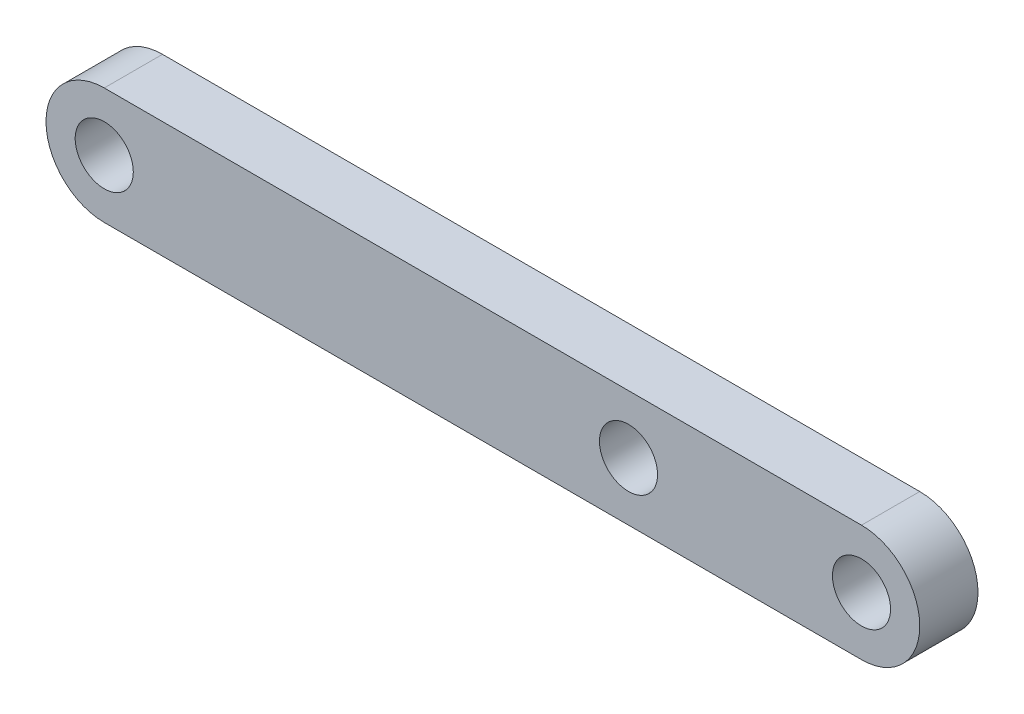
ISO-10303-21;
HEADER;
FILE_DESCRIPTION(('STEP AP214'),'2;1');
FILE_NAME('part.step','',(''),(''),'','','');
FILE_SCHEMA(('AUTOMOTIVE_DESIGN { 1 0 10303 214 1 1 1 1 }'));
ENDSEC;
DATA;
#1=APPLICATION_CONTEXT('core data for automotive mechanical design processes');
#2=APPLICATION_PROTOCOL_DEFINITION('international standard','automotive_design',2000,#1);
#3=PRODUCT_CONTEXT('',#1,'mechanical');
#4=PRODUCT('Part','Part','',(#3));
#5=PRODUCT_RELATED_PRODUCT_CATEGORY('part','',(#4));
#6=PRODUCT_DEFINITION_FORMATION('','',#4);
#7=PRODUCT_DEFINITION_CONTEXT('part definition',#1,'design');
#8=PRODUCT_DEFINITION('design','',#6,#7);
#9=PRODUCT_DEFINITION_SHAPE('','',#8);
#10=(LENGTH_UNIT() NAMED_UNIT(*) SI_UNIT(.MILLI.,.METRE.));
#11=(NAMED_UNIT(*) PLANE_ANGLE_UNIT() SI_UNIT($,.RADIAN.));
#12=(NAMED_UNIT(*) SI_UNIT($,.STERADIAN.) SOLID_ANGLE_UNIT());
#13=UNCERTAINTY_MEASURE_WITH_UNIT(LENGTH_MEASURE(1.E-05),#10,'distance_accuracy_value','');
#14=(GEOMETRIC_REPRESENTATION_CONTEXT(3) GLOBAL_UNCERTAINTY_ASSIGNED_CONTEXT((#13)) GLOBAL_UNIT_ASSIGNED_CONTEXT((#10,
#11,#12)) REPRESENTATION_CONTEXT('',''));
#15=CARTESIAN_POINT('',(0.,0.,0.));
#16=DIRECTION('',(0.,0.,1.));
#17=DIRECTION('',(1.,0.,0.));
#18=AXIS2_PLACEMENT_3D('',#15,#16,#17);
#19=CARTESIAN_POINT('',(-20.6375,0.,-3.175));
#20=DIRECTION('',(0.,0.,1.));
#21=DIRECTION('',(1.,0.,0.));
#22=AXIS2_PLACEMENT_3D('',#19,#20,#21);
#23=CYLINDRICAL_SURFACE('',#22,3.175);
#24=CARTESIAN_POINT('',(-20.6375,0.,0.));
#25=DIRECTION('',(0.,0.,1.));
#26=DIRECTION('',(1.,0.,0.));
#27=AXIS2_PLACEMENT_3D('',#24,#25,#26);
#28=CIRCLE('',#27,3.175);
#29=CARTESIAN_POINT('',(-20.6375,3.175,0.));
#30=VERTEX_POINT('',#29);
#31=CARTESIAN_POINT('',(-20.6375,-3.175,0.));
#32=VERTEX_POINT('',#31);
#33=EDGE_CURVE('E102',#30,#32,#28,.T.);
#34=ORIENTED_EDGE('',*,*,#33,.F.);
#35=DIRECTION('',(0.,0.,1.));
#36=VECTOR('',#35,1.);
#37=CARTESIAN_POINT('',(-20.6375,3.175,-3.175));
#38=LINE('',#37,#36);
#39=CARTESIAN_POINT('',(-20.6375,3.175,-3.175));
#40=VERTEX_POINT('',#39);
#41=EDGE_CURVE('E11',#40,#30,#38,.T.);
#42=ORIENTED_EDGE('',*,*,#41,.F.);
#43=CARTESIAN_POINT('',(-20.6375,0.,-3.175));
#44=DIRECTION('',(0.,0.,1.));
#45=DIRECTION('',(1.,0.,0.));
#46=AXIS2_PLACEMENT_3D('',#43,#44,#45);
#47=CIRCLE('',#46,3.175);
#48=CARTESIAN_POINT('',(-20.6375,-3.175,-3.175));
#49=VERTEX_POINT('',#48);
#50=EDGE_CURVE('E95',#40,#49,#47,.T.);
#51=ORIENTED_EDGE('',*,*,#50,.T.);
#52=DIRECTION('',(0.,0.,1.));
#53=VECTOR('',#52,1.);
#54=CARTESIAN_POINT('',(-20.6375,-3.175,-3.175));
#55=LINE('',#54,#53);
#56=EDGE_CURVE('E40',#49,#32,#55,.T.);
#57=ORIENTED_EDGE('',*,*,#56,.T.);
#58=EDGE_LOOP('',(#34,#42,#51,#57));
#59=FACE_BOUND('',#58,.T.);
#60=ADVANCED_FACE('F37',(#59),#23,.T.);
#61=CARTESIAN_POINT('',(-20.6375,3.175,-3.175));
#62=DIRECTION('',(0.,1.,0.));
#63=DIRECTION('',(0.,0.,1.));
#64=AXIS2_PLACEMENT_3D('',#61,#62,#63);
#65=PLANE('',#64);
#66=DIRECTION('',(-1.,0.,0.));
#67=VECTOR('',#66,1.);
#68=CARTESIAN_POINT('',(-20.6375,3.175,0.));
#69=LINE('',#68,#67);
#70=CARTESIAN_POINT('',(20.6375,3.175,0.));
#71=VERTEX_POINT('',#70);
#72=EDGE_CURVE('E97',#71,#30,#69,.T.);
#73=ORIENTED_EDGE('',*,*,#72,.F.);
#74=DIRECTION('',(0.,0.,1.));
#75=VECTOR('',#74,1.);
#76=CARTESIAN_POINT('',(20.6375,3.175,-3.175));
#77=LINE('',#76,#75);
#78=CARTESIAN_POINT('',(20.6375,3.175,-3.175));
#79=VERTEX_POINT('',#78);
#80=EDGE_CURVE('E46',#79,#71,#77,.T.);
#81=ORIENTED_EDGE('',*,*,#80,.F.);
#82=DIRECTION('',(-1.,0.,0.));
#83=VECTOR('',#82,1.);
#84=CARTESIAN_POINT('',(-20.6375,3.175,-3.175));
#85=LINE('',#84,#83);
#86=EDGE_CURVE('E92',#79,#40,#85,.T.);
#87=ORIENTED_EDGE('',*,*,#86,.T.);
#88=ORIENTED_EDGE('',*,*,#41,.T.);
#89=EDGE_LOOP('',(#73,#81,#87,#88));
#90=FACE_BOUND('',#89,.T.);
#91=ADVANCED_FACE('F113',(#90),#65,.T.);
#92=CARTESIAN_POINT('',(20.6375,0.,-3.175));
#93=DIRECTION('',(0.,0.,1.));
#94=DIRECTION('',(1.,0.,0.));
#95=AXIS2_PLACEMENT_3D('',#92,#93,#94);
#96=CYLINDRICAL_SURFACE('',#95,3.175);
#97=CARTESIAN_POINT('',(20.6375,0.,0.));
#98=DIRECTION('',(0.,0.,1.));
#99=DIRECTION('',(1.,0.,0.));
#100=AXIS2_PLACEMENT_3D('',#97,#98,#99);
#101=CIRCLE('',#100,3.175);
#102=CARTESIAN_POINT('',(20.6375,-3.175,0.));
#103=VERTEX_POINT('',#102);
#104=EDGE_CURVE('E87',#103,#71,#101,.T.);
#105=ORIENTED_EDGE('',*,*,#104,.F.);
#106=DIRECTION('',(0.,0.,1.));
#107=VECTOR('',#106,1.);
#108=CARTESIAN_POINT('',(20.6375,-3.175,-3.175));
#109=LINE('',#108,#107);
#110=CARTESIAN_POINT('',(20.6375,-3.175,-3.175));
#111=VERTEX_POINT('',#110);
#112=EDGE_CURVE('E82',#111,#103,#109,.T.);
#113=ORIENTED_EDGE('',*,*,#112,.F.);
#114=CARTESIAN_POINT('',(20.6375,0.,-3.175));
#115=DIRECTION('',(0.,0.,1.));
#116=DIRECTION('',(1.,0.,0.));
#117=AXIS2_PLACEMENT_3D('',#114,#115,#116);
#118=CIRCLE('',#117,3.175);
#119=EDGE_CURVE('E85',#111,#79,#118,.T.);
#120=ORIENTED_EDGE('',*,*,#119,.T.);
#121=ORIENTED_EDGE('',*,*,#80,.T.);
#122=EDGE_LOOP('',(#105,#113,#120,#121));
#123=FACE_BOUND('',#122,.T.);
#124=ADVANCED_FACE('F84',(#123),#96,.T.);
#125=CARTESIAN_POINT('',(-20.6375,-3.175,-3.175));
#126=DIRECTION('',(0.,-1.,0.));
#127=DIRECTION('',(0.,0.,-1.));
#128=AXIS2_PLACEMENT_3D('',#125,#126,#127);
#129=PLANE('',#128);
#130=DIRECTION('',(1.,0.,0.));
#131=VECTOR('',#130,1.);
#132=CARTESIAN_POINT('',(-20.6375,-3.175,0.));
#133=LINE('',#132,#131);
#134=EDGE_CURVE('E105',#32,#103,#133,.T.);
#135=ORIENTED_EDGE('',*,*,#134,.F.);
#136=ORIENTED_EDGE('',*,*,#56,.F.);
#137=DIRECTION('',(1.,0.,0.));
#138=VECTOR('',#137,1.);
#139=CARTESIAN_POINT('',(-20.6375,-3.175,-3.175));
#140=LINE('',#139,#138);
#141=EDGE_CURVE('E91',#49,#111,#140,.T.);
#142=ORIENTED_EDGE('',*,*,#141,.T.);
#143=ORIENTED_EDGE('',*,*,#112,.T.);
#144=EDGE_LOOP('',(#135,#136,#142,#143));
#145=FACE_BOUND('',#144,.T.);
#146=ADVANCED_FACE('F94',(#145),#129,.T.);
#147=CARTESIAN_POINT('',(-20.6375,0.,-3.175));
#148=DIRECTION('',(0.,0.,1.));
#149=DIRECTION('',(1.,0.,0.));
#150=AXIS2_PLACEMENT_3D('',#147,#148,#149);
#151=PLANE('',#150);
#152=CARTESIAN_POINT('',(20.6375,0.,-3.175));
#153=DIRECTION('',(0.,0.,1.));
#154=DIRECTION('',(1.,0.,0.));
#155=AXIS2_PLACEMENT_3D('',#152,#153,#154);
#156=CIRCLE('',#155,1.58420004);
#157=CARTESIAN_POINT('',(22.22170004,0.,-3.175));
#158=VERTEX_POINT('',#157);
#159=EDGE_CURVE('E150',#158,#158,#156,.T.);
#160=ORIENTED_EDGE('',*,*,#159,.T.);
#161=EDGE_LOOP('',(#160));
#162=FACE_BOUND('',#161,.T.);
#163=CARTESIAN_POINT('',(7.9375,0.,-3.175));
#164=DIRECTION('',(0.,0.,1.));
#165=DIRECTION('',(1.,0.,0.));
#166=AXIS2_PLACEMENT_3D('',#163,#164,#165);
#167=CIRCLE('',#166,1.584200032);
#168=CARTESIAN_POINT('',(9.521700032,0.,-3.175));
#169=VERTEX_POINT('',#168);
#170=EDGE_CURVE('E158',#169,#169,#167,.T.);
#171=ORIENTED_EDGE('',*,*,#170,.T.);
#172=EDGE_LOOP('',(#171));
#173=FACE_BOUND('',#172,.T.);
#174=CARTESIAN_POINT('',(-20.6375,0.,-3.175));
#175=DIRECTION('',(0.,0.,1.));
#176=DIRECTION('',(1.,0.,0.));
#177=AXIS2_PLACEMENT_3D('',#174,#175,#176);
#178=CIRCLE('',#177,1.584200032);
#179=CARTESIAN_POINT('',(-19.053299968,0.,-3.175));
#180=VERTEX_POINT('',#179);
#181=EDGE_CURVE('E106',#180,#180,#178,.T.);
#182=ORIENTED_EDGE('',*,*,#181,.T.);
#183=EDGE_LOOP('',(#182));
#184=FACE_BOUND('',#183,.T.);
#185=ORIENTED_EDGE('',*,*,#50,.F.);
#186=ORIENTED_EDGE('',*,*,#86,.F.);
#187=ORIENTED_EDGE('',*,*,#119,.F.);
#188=ORIENTED_EDGE('',*,*,#141,.F.);
#189=EDGE_LOOP('',(#185,#186,#187,#188));
#190=FACE_BOUND('',#189,.T.);
#191=ADVANCED_FACE('F90',(#162,#173,#184,#190),#151,.F.);
#192=CARTESIAN_POINT('',(-20.6375,0.,0.));
#193=DIRECTION('',(0.,0.,1.));
#194=DIRECTION('',(1.,0.,0.));
#195=AXIS2_PLACEMENT_3D('',#192,#193,#194);
#196=PLANE('',#195);
#197=CARTESIAN_POINT('',(20.6375,0.,0.));
#198=DIRECTION('',(0.,0.,1.));
#199=DIRECTION('',(1.,0.,0.));
#200=AXIS2_PLACEMENT_3D('',#197,#198,#199);
#201=CIRCLE('',#200,1.58420004);
#202=CARTESIAN_POINT('',(22.22170004,0.,0.));
#203=VERTEX_POINT('',#202);
#204=EDGE_CURVE('E153',#203,#203,#201,.T.);
#205=ORIENTED_EDGE('',*,*,#204,.F.);
#206=EDGE_LOOP('',(#205));
#207=FACE_BOUND('',#206,.T.);
#208=CARTESIAN_POINT('',(7.9375,0.,0.));
#209=DIRECTION('',(0.,0.,1.));
#210=DIRECTION('',(1.,0.,0.));
#211=AXIS2_PLACEMENT_3D('',#208,#209,#210);
#212=CIRCLE('',#211,1.584200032);
#213=CARTESIAN_POINT('',(9.521700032,0.,0.));
#214=VERTEX_POINT('',#213);
#215=EDGE_CURVE('E155',#214,#214,#212,.T.);
#216=ORIENTED_EDGE('',*,*,#215,.F.);
#217=EDGE_LOOP('',(#216));
#218=FACE_BOUND('',#217,.T.);
#219=CARTESIAN_POINT('',(-20.6375,0.,0.));
#220=DIRECTION('',(0.,0.,1.));
#221=DIRECTION('',(1.,0.,0.));
#222=AXIS2_PLACEMENT_3D('',#219,#220,#221);
#223=CIRCLE('',#222,1.584200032);
#224=CARTESIAN_POINT('',(-19.053299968,0.,0.));
#225=VERTEX_POINT('',#224);
#226=EDGE_CURVE('E161',#225,#225,#223,.T.);
#227=ORIENTED_EDGE('',*,*,#226,.F.);
#228=EDGE_LOOP('',(#227));
#229=FACE_BOUND('',#228,.T.);
#230=ORIENTED_EDGE('',*,*,#33,.T.);
#231=ORIENTED_EDGE('',*,*,#134,.T.);
#232=ORIENTED_EDGE('',*,*,#104,.T.);
#233=ORIENTED_EDGE('',*,*,#72,.T.);
#234=EDGE_LOOP('',(#230,#231,#232,#233));
#235=FACE_BOUND('',#234,.T.);
#236=ADVANCED_FACE('F112',(#207,#218,#229,#235),#196,.T.);
#237=CARTESIAN_POINT('',(-20.6375,0.,-3.175));
#238=DIRECTION('',(0.,0.,1.));
#239=DIRECTION('',(1.,0.,0.));
#240=AXIS2_PLACEMENT_3D('',#237,#238,#239);
#241=CYLINDRICAL_SURFACE('',#240,1.584200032);
#242=ORIENTED_EDGE('',*,*,#181,.F.);
#243=EDGE_LOOP('',(#242));
#244=FACE_BOUND('',#243,.T.);
#245=ORIENTED_EDGE('',*,*,#226,.T.);
#246=EDGE_LOOP('',(#245));
#247=FACE_BOUND('',#246,.T.);
#248=ADVANCED_FACE('F131',(#244,#247),#241,.F.);
#249=CARTESIAN_POINT('',(7.9375,0.,-3.175));
#250=DIRECTION('',(0.,0.,1.));
#251=DIRECTION('',(1.,0.,0.));
#252=AXIS2_PLACEMENT_3D('',#249,#250,#251);
#253=CYLINDRICAL_SURFACE('',#252,1.584200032);
#254=ORIENTED_EDGE('',*,*,#170,.F.);
#255=EDGE_LOOP('',(#254));
#256=FACE_BOUND('',#255,.T.);
#257=ORIENTED_EDGE('',*,*,#215,.T.);
#258=EDGE_LOOP('',(#257));
#259=FACE_BOUND('',#258,.T.);
#260=ADVANCED_FACE('F138',(#256,#259),#253,.F.);
#261=CARTESIAN_POINT('',(20.6375,0.,-3.175));
#262=DIRECTION('',(0.,0.,1.));
#263=DIRECTION('',(1.,0.,0.));
#264=AXIS2_PLACEMENT_3D('',#261,#262,#263);
#265=CYLINDRICAL_SURFACE('',#264,1.58420004);
#266=ORIENTED_EDGE('',*,*,#159,.F.);
#267=EDGE_LOOP('',(#266));
#268=FACE_BOUND('',#267,.T.);
#269=ORIENTED_EDGE('',*,*,#204,.T.);
#270=EDGE_LOOP('',(#269));
#271=FACE_BOUND('',#270,.T.);
#272=ADVANCED_FACE('F142',(#268,#271),#265,.F.);
#273=CLOSED_SHELL('',(#60,#91,#124,#146,#191,#236,#248,#260,#272));
#274=MANIFOLD_SOLID_BREP('B2',#273);
#275=ADVANCED_BREP_SHAPE_REPRESENTATION('',(#18,#274),#14);
#276=SHAPE_DEFINITION_REPRESENTATION(#9,#275);
ENDSEC;
END-ISO-10303-21;
